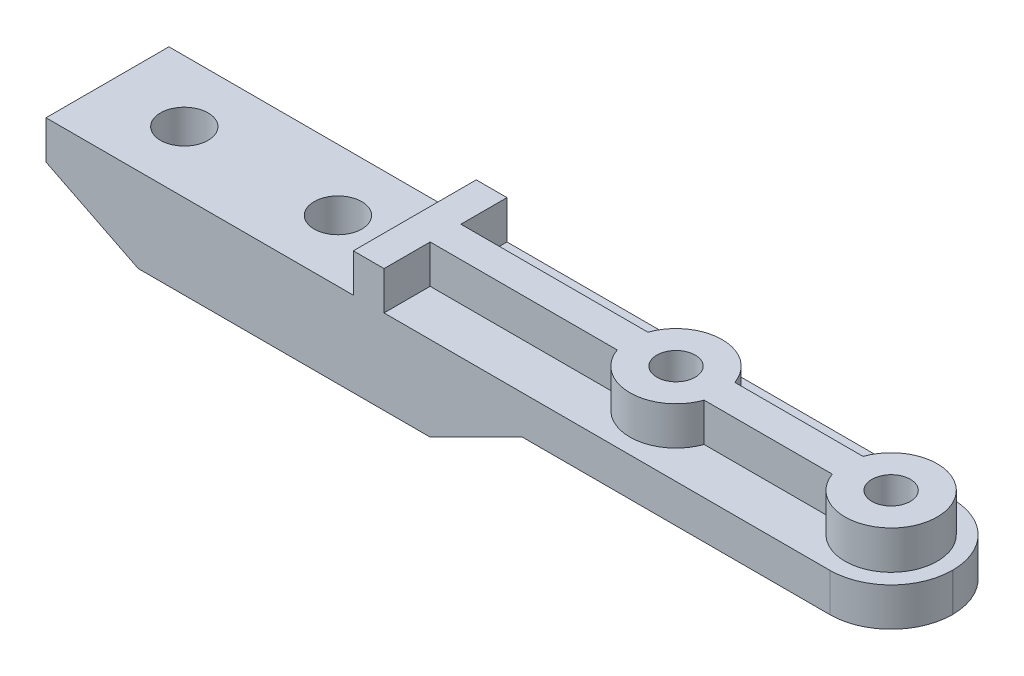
ISO-10303-21;
HEADER;
FILE_DESCRIPTION(('STEP AP214'),'2;1');
FILE_NAME('part.step','',(''),(''),'','','');
FILE_SCHEMA(('AUTOMOTIVE_DESIGN { 1 0 10303 214 1 1 1 1 }'));
ENDSEC;
DATA;
#1=APPLICATION_CONTEXT('core data for automotive mechanical design processes');
#2=APPLICATION_PROTOCOL_DEFINITION('international standard','automotive_design',2000,#1);
#3=PRODUCT_CONTEXT('',#1,'mechanical');
#4=PRODUCT('Part','Part','',(#3));
#5=PRODUCT_RELATED_PRODUCT_CATEGORY('part','',(#4));
#6=PRODUCT_DEFINITION_FORMATION('','',#4);
#7=PRODUCT_DEFINITION_CONTEXT('part definition',#1,'design');
#8=PRODUCT_DEFINITION('design','',#6,#7);
#9=PRODUCT_DEFINITION_SHAPE('','',#8);
#10=(LENGTH_UNIT() NAMED_UNIT(*) SI_UNIT(.MILLI.,.METRE.));
#11=(NAMED_UNIT(*) PLANE_ANGLE_UNIT() SI_UNIT($,.RADIAN.));
#12=(NAMED_UNIT(*) SI_UNIT($,.STERADIAN.) SOLID_ANGLE_UNIT());
#13=UNCERTAINTY_MEASURE_WITH_UNIT(LENGTH_MEASURE(1.E-05),#10,'distance_accuracy_value','');
#14=(GEOMETRIC_REPRESENTATION_CONTEXT(3) GLOBAL_UNCERTAINTY_ASSIGNED_CONTEXT((#13)) GLOBAL_UNIT_ASSIGNED_CONTEXT((#10,
#11,#12)) REPRESENTATION_CONTEXT('',''));
#15=CARTESIAN_POINT('',(0.,0.,0.));
#16=DIRECTION('',(0.,0.,1.));
#17=DIRECTION('',(1.,0.,0.));
#18=AXIS2_PLACEMENT_3D('',#15,#16,#17);
#19=CARTESIAN_POINT('',(-44.,0.,4.));
#20=DIRECTION('',(0.,1.,0.));
#21=DIRECTION('',(-1.,0.,0.));
#22=AXIS2_PLACEMENT_3D('',#19,#20,#21);
#23=PLANE('',#22);
#24=CARTESIAN_POINT('',(-29.,0.,0.));
#25=DIRECTION('',(0.,-1.,0.));
#26=DIRECTION('',(0.,0.,-1.));
#27=AXIS2_PLACEMENT_3D('',#24,#25,#26);
#28=CIRCLE('',#27,1.55);
#29=CARTESIAN_POINT('',(-29.,0.,-1.55));
#30=VERTEX_POINT('',#29);
#31=EDGE_CURVE('E269',#30,#30,#28,.T.);
#32=ORIENTED_EDGE('',*,*,#31,.F.);
#33=EDGE_LOOP('',(#32));
#34=FACE_BOUND('',#33,.T.);
#35=CARTESIAN_POINT('',(-39.,0.,0.));
#36=DIRECTION('',(0.,-1.,0.));
#37=DIRECTION('',(0.,0.,-1.));
#38=AXIS2_PLACEMENT_3D('',#35,#36,#37);
#39=CIRCLE('',#38,1.55);
#40=CARTESIAN_POINT('',(-39.,0.,-1.55));
#41=VERTEX_POINT('',#40);
#42=EDGE_CURVE('E278',#41,#41,#39,.T.);
#43=ORIENTED_EDGE('',*,*,#42,.F.);
#44=EDGE_LOOP('',(#43));
#45=FACE_BOUND('',#44,.T.);
#46=CARTESIAN_POINT('',(-7.,0.,0.));
#47=DIRECTION('',(0.,-1.,0.));
#48=DIRECTION('',(0.,0.,-1.));
#49=AXIS2_PLACEMENT_3D('',#46,#47,#48);
#50=CIRCLE('',#49,1.25);
#51=CARTESIAN_POINT('',(-7.,0.,-1.25));
#52=VERTEX_POINT('',#51);
#53=EDGE_CURVE('E284',#52,#52,#50,.T.);
#54=ORIENTED_EDGE('',*,*,#53,.F.);
#55=EDGE_LOOP('',(#54));
#56=FACE_BOUND('',#55,.T.);
#57=CARTESIAN_POINT('',(7.,0.,0.));
#58=DIRECTION('',(0.,-1.,0.));
#59=DIRECTION('',(0.,0.,-1.));
#60=AXIS2_PLACEMENT_3D('',#57,#58,#59);
#61=CIRCLE('',#60,1.25);
#62=CARTESIAN_POINT('',(7.,0.,-1.25));
#63=VERTEX_POINT('',#62);
#64=EDGE_CURVE('E290',#63,#63,#61,.T.);
#65=ORIENTED_EDGE('',*,*,#64,.F.);
#66=EDGE_LOOP('',(#65));
#67=FACE_BOUND('',#66,.T.);
#68=DIRECTION('',(-1.,0.,0.));
#69=VECTOR('',#68,1.);
#70=CARTESIAN_POINT('',(-13.,0.,-3.));
#71=LINE('',#70,#69);
#72=CARTESIAN_POINT('',(-13.,0.,-3.));
#73=VERTEX_POINT('',#72);
#74=CARTESIAN_POINT('',(-44.,0.,-3.));
#75=VERTEX_POINT('',#74);
#76=EDGE_CURVE('E215',#73,#75,#71,.T.);
#77=ORIENTED_EDGE('',*,*,#76,.F.);
#78=DIRECTION('',(0.,0.,1.));
#79=VECTOR('',#78,1.);
#80=CARTESIAN_POINT('',(-13.,0.,-3.));
#81=LINE('',#80,#79);
#82=CARTESIAN_POINT('',(-13.,0.,-4.));
#83=VERTEX_POINT('',#82);
#84=EDGE_CURVE('E212',#83,#73,#81,.T.);
#85=ORIENTED_EDGE('',*,*,#84,.F.);
#86=DIRECTION('',(1.,0.,0.));
#87=VECTOR('',#86,1.);
#88=CARTESIAN_POINT('',(-44.,0.,-4.));
#89=LINE('',#88,#87);
#90=CARTESIAN_POINT('',(7.01,0.,-4.));
#91=VERTEX_POINT('',#90);
#92=EDGE_CURVE('E195',#83,#91,#89,.T.);
#93=ORIENTED_EDGE('',*,*,#92,.T.);
#94=CARTESIAN_POINT('',(7.00999999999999,0.,-0.00999999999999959));
#95=DIRECTION('',(0.,1.,0.));
#96=DIRECTION('',(-1.,0.,0.));
#97=AXIS2_PLACEMENT_3D('',#94,#95,#96);
#98=CIRCLE('',#97,3.99);
#99=CARTESIAN_POINT('',(11.,0.,-0.00999999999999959));
#100=VERTEX_POINT('',#99);
#101=EDGE_CURVE('E396',#91,#100,#98,.F.);
#102=ORIENTED_EDGE('',*,*,#101,.T.);
#103=DIRECTION('',(0.,0.,-1.));
#104=VECTOR('',#103,1.);
#105=CARTESIAN_POINT('',(11.,0.,4.));
#106=LINE('',#105,#104);
#107=CARTESIAN_POINT('',(11.,0.,0.00999999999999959));
#108=VERTEX_POINT('',#107);
#109=EDGE_CURVE('E260',#108,#100,#106,.T.);
#110=ORIENTED_EDGE('',*,*,#109,.F.);
#111=CARTESIAN_POINT('',(7.01,0.,0.00999999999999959));
#112=DIRECTION('',(0.,1.,0.));
#113=DIRECTION('',(-1.,0.,0.));
#114=AXIS2_PLACEMENT_3D('',#111,#112,#113);
#115=CIRCLE('',#114,3.99);
#116=CARTESIAN_POINT('',(7.01,0.,4.));
#117=VERTEX_POINT('',#116);
#118=EDGE_CURVE('E398',#108,#117,#115,.F.);
#119=ORIENTED_EDGE('',*,*,#118,.T.);
#120=DIRECTION('',(1.,0.,0.));
#121=VECTOR('',#120,1.);
#122=CARTESIAN_POINT('',(-44.,0.,4.));
#123=LINE('',#122,#121);
#124=CARTESIAN_POINT('',(-13.,0.,4.));
#125=VERTEX_POINT('',#124);
#126=EDGE_CURVE('E371',#125,#117,#123,.T.);
#127=ORIENTED_EDGE('',*,*,#126,.F.);
#128=DIRECTION('',(0.,0.,1.));
#129=VECTOR('',#128,1.);
#130=CARTESIAN_POINT('',(-13.,0.,3.));
#131=LINE('',#130,#129);
#132=CARTESIAN_POINT('',(-13.,0.,3.));
#133=VERTEX_POINT('',#132);
#134=EDGE_CURVE('E251',#133,#125,#131,.T.);
#135=ORIENTED_EDGE('',*,*,#134,.F.);
#136=DIRECTION('',(1.,0.,0.));
#137=VECTOR('',#136,1.);
#138=CARTESIAN_POINT('',(-13.,0.,3.));
#139=LINE('',#138,#137);
#140=CARTESIAN_POINT('',(-44.,0.,3.));
#141=VERTEX_POINT('',#140);
#142=EDGE_CURVE('E244',#141,#133,#139,.T.);
#143=ORIENTED_EDGE('',*,*,#142,.F.);
#144=DIRECTION('',(0.,0.,-1.));
#145=VECTOR('',#144,1.);
#146=CARTESIAN_POINT('',(-44.,0.,4.));
#147=LINE('',#146,#145);
#148=EDGE_CURVE('E248',#141,#75,#147,.T.);
#149=ORIENTED_EDGE('',*,*,#148,.T.);
#150=EDGE_LOOP('',(#77,#85,#93,#102,#110,#119,#127,#135,#143,#149));
#151=FACE_BOUND('',#150,.T.);
#152=ADVANCED_FACE('F28',(#34,#45,#56,#67,#151),#23,.F.);
#153=CARTESIAN_POINT('',(-44.,2.5,4.));
#154=DIRECTION('',(0.,-1.,0.));
#155=DIRECTION('',(0.,0.,-1.));
#156=AXIS2_PLACEMENT_3D('',#153,#154,#155);
#157=PLANE('',#156);
#158=CARTESIAN_POINT('',(-29.,2.5,0.));
#159=DIRECTION('',(0.,-1.,0.));
#160=DIRECTION('',(0.,0.,-1.));
#161=AXIS2_PLACEMENT_3D('',#158,#159,#160);
#162=CIRCLE('',#161,1.55);
#163=CARTESIAN_POINT('',(-29.,2.5,-1.55));
#164=VERTEX_POINT('',#163);
#165=EDGE_CURVE('E275',#164,#164,#162,.T.);
#166=ORIENTED_EDGE('',*,*,#165,.T.);
#167=EDGE_LOOP('',(#166));
#168=FACE_BOUND('',#167,.T.);
#169=CARTESIAN_POINT('',(-39.,2.5,0.));
#170=DIRECTION('',(0.,-1.,0.));
#171=DIRECTION('',(0.,0.,-1.));
#172=AXIS2_PLACEMENT_3D('',#169,#170,#171);
#173=CIRCLE('',#172,1.55);
#174=CARTESIAN_POINT('',(-39.,2.5,-1.55));
#175=VERTEX_POINT('',#174);
#176=EDGE_CURVE('E281',#175,#175,#173,.T.);
#177=ORIENTED_EDGE('',*,*,#176,.T.);
#178=EDGE_LOOP('',(#177));
#179=FACE_BOUND('',#178,.T.);
#180=DIRECTION('',(0.,0.,1.));
#181=VECTOR('',#180,1.);
#182=CARTESIAN_POINT('',(-24.,2.5,4.));
#183=LINE('',#182,#181);
#184=CARTESIAN_POINT('',(-24.,2.5,-4.));
#185=VERTEX_POINT('',#184);
#186=CARTESIAN_POINT('',(-24.,2.5,4.));
#187=VERTEX_POINT('',#186);
#188=EDGE_CURVE('E357',#185,#187,#183,.T.);
#189=ORIENTED_EDGE('',*,*,#188,.F.);
#190=DIRECTION('',(-1.,0.,0.));
#191=VECTOR('',#190,1.);
#192=CARTESIAN_POINT('',(-44.,2.5,-4.));
#193=LINE('',#192,#191);
#194=CARTESIAN_POINT('',(-44.,2.5,-4.));
#195=VERTEX_POINT('',#194);
#196=EDGE_CURVE('E207',#185,#195,#193,.T.);
#197=ORIENTED_EDGE('',*,*,#196,.T.);
#198=DIRECTION('',(0.,0.,-1.));
#199=VECTOR('',#198,1.);
#200=CARTESIAN_POINT('',(-44.,2.5,4.));
#201=LINE('',#200,#199);
#202=CARTESIAN_POINT('',(-44.,2.5,4.));
#203=VERTEX_POINT('',#202);
#204=EDGE_CURVE('E377',#203,#195,#201,.T.);
#205=ORIENTED_EDGE('',*,*,#204,.F.);
#206=DIRECTION('',(-1.,0.,0.));
#207=VECTOR('',#206,1.);
#208=CARTESIAN_POINT('',(-44.,2.5,4.));
#209=LINE('',#208,#207);
#210=EDGE_CURVE('E373',#187,#203,#209,.T.);
#211=ORIENTED_EDGE('',*,*,#210,.F.);
#212=EDGE_LOOP('',(#189,#197,#205,#211));
#213=FACE_BOUND('',#212,.T.);
#214=ADVANCED_FACE('F474',(#168,#179,#213),#157,.F.);
#215=DIRECTION('',(0.,0.,-1.));
#216=VECTOR('',#215,1.);
#217=CARTESIAN_POINT('',(-22.,2.5,4.));
#218=LINE('',#217,#216);
#219=CARTESIAN_POINT('',(-22.,2.5,-1.));
#220=VERTEX_POINT('',#219);
#221=CARTESIAN_POINT('',(-22.,2.5,-4.));
#222=VERTEX_POINT('',#221);
#223=EDGE_CURVE('E360',#220,#222,#218,.T.);
#224=ORIENTED_EDGE('',*,*,#223,.F.);
#225=DIRECTION('',(-1.,0.,0.));
#226=VECTOR('',#225,1.);
#227=CARTESIAN_POINT('',(-44.,2.5,-1.));
#228=LINE('',#227,#226);
#229=CARTESIAN_POINT('',(-9.82842712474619,2.5,-1.));
#230=VERTEX_POINT('',#229);
#231=EDGE_CURVE('E420',#230,#220,#228,.T.);
#232=ORIENTED_EDGE('',*,*,#231,.F.);
#233=CARTESIAN_POINT('',(-7.,2.5,0.));
#234=DIRECTION('',(0.,-1.,0.));
#235=DIRECTION('',(0.,0.,-1.));
#236=AXIS2_PLACEMENT_3D('',#233,#234,#235);
#237=CIRCLE('',#236,3.);
#238=CARTESIAN_POINT('',(-4.17157287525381,2.5,-1.));
#239=VERTEX_POINT('',#238);
#240=EDGE_CURVE('E417',#239,#230,#237,.F.);
#241=ORIENTED_EDGE('',*,*,#240,.F.);
#242=DIRECTION('',(-1.,0.,0.));
#243=VECTOR('',#242,1.);
#244=CARTESIAN_POINT('',(-44.,2.5,-1.));
#245=LINE('',#244,#243);
#246=CARTESIAN_POINT('',(4.17157287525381,2.5,-1.));
#247=VERTEX_POINT('',#246);
#248=EDGE_CURVE('E414',#247,#239,#245,.T.);
#249=ORIENTED_EDGE('',*,*,#248,.F.);
#250=CARTESIAN_POINT('',(7.,2.5,0.));
#251=DIRECTION('',(0.,-1.,0.));
#252=DIRECTION('',(0.,0.,-1.));
#253=AXIS2_PLACEMENT_3D('',#250,#251,#252);
#254=CIRCLE('',#253,3.);
#255=CARTESIAN_POINT('',(4.17157287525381,2.5,1.));
#256=VERTEX_POINT('',#255);
#257=EDGE_CURVE('E411',#256,#247,#254,.F.);
#258=ORIENTED_EDGE('',*,*,#257,.F.);
#259=DIRECTION('',(1.,0.,0.));
#260=VECTOR('',#259,1.);
#261=CARTESIAN_POINT('',(-44.,2.5,1.));
#262=LINE('',#261,#260);
#263=CARTESIAN_POINT('',(-4.17157287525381,2.5,1.));
#264=VERTEX_POINT('',#263);
#265=EDGE_CURVE('E408',#264,#256,#262,.T.);
#266=ORIENTED_EDGE('',*,*,#265,.F.);
#267=CARTESIAN_POINT('',(-7.,2.5,0.));
#268=DIRECTION('',(0.,-1.,0.));
#269=DIRECTION('',(0.,0.,-1.));
#270=AXIS2_PLACEMENT_3D('',#267,#268,#269);
#271=CIRCLE('',#270,3.);
#272=CARTESIAN_POINT('',(-9.82842712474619,2.5,1.));
#273=VERTEX_POINT('',#272);
#274=EDGE_CURVE('E405',#273,#264,#271,.F.);
#275=ORIENTED_EDGE('',*,*,#274,.F.);
#276=DIRECTION('',(1.,0.,0.));
#277=VECTOR('',#276,1.);
#278=CARTESIAN_POINT('',(-44.,2.5,1.));
#279=LINE('',#278,#277);
#280=CARTESIAN_POINT('',(-22.,2.5,1.));
#281=VERTEX_POINT('',#280);
#282=EDGE_CURVE('E402',#281,#273,#279,.T.);
#283=ORIENTED_EDGE('',*,*,#282,.F.);
#284=DIRECTION('',(0.,0.,-1.));
#285=VECTOR('',#284,1.);
#286=CARTESIAN_POINT('',(-22.,2.5,4.));
#287=LINE('',#286,#285);
#288=CARTESIAN_POINT('',(-22.,2.5,4.));
#289=VERTEX_POINT('',#288);
#290=EDGE_CURVE('E363',#289,#281,#287,.T.);
#291=ORIENTED_EDGE('',*,*,#290,.F.);
#292=CARTESIAN_POINT('',(7.01,2.5,4.));
#293=VERTEX_POINT('',#292);
#294=EDGE_CURVE('E374',#293,#289,#209,.T.);
#295=ORIENTED_EDGE('',*,*,#294,.F.);
#296=CARTESIAN_POINT('',(7.01,2.5,0.00999999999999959));
#297=DIRECTION('',(0.,-1.,0.));
#298=DIRECTION('',(0.,0.,-1.));
#299=AXIS2_PLACEMENT_3D('',#296,#297,#298);
#300=CIRCLE('',#299,3.99);
#301=CARTESIAN_POINT('',(11.,2.5,0.00999999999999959));
#302=VERTEX_POINT('',#301);
#303=EDGE_CURVE('E389',#293,#302,#300,.F.);
#304=ORIENTED_EDGE('',*,*,#303,.T.);
#305=DIRECTION('',(0.,0.,-1.));
#306=VECTOR('',#305,1.);
#307=CARTESIAN_POINT('',(11.,2.5,4.));
#308=LINE('',#307,#306);
#309=CARTESIAN_POINT('',(11.,2.5,-0.00999999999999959));
#310=VERTEX_POINT('',#309);
#311=EDGE_CURVE('E380',#302,#310,#308,.T.);
#312=ORIENTED_EDGE('',*,*,#311,.T.);
#313=CARTESIAN_POINT('',(7.00999999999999,2.5,-0.00999999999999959));
#314=DIRECTION('',(0.,-1.,0.));
#315=DIRECTION('',(0.,0.,-1.));
#316=AXIS2_PLACEMENT_3D('',#313,#314,#315);
#317=CIRCLE('',#316,3.99);
#318=CARTESIAN_POINT('',(7.01,2.5,-4.));
#319=VERTEX_POINT('',#318);
#320=EDGE_CURVE('E387',#310,#319,#317,.F.);
#321=ORIENTED_EDGE('',*,*,#320,.T.);
#322=EDGE_CURVE('E367',#319,#222,#193,.T.);
#323=ORIENTED_EDGE('',*,*,#322,.T.);
#324=EDGE_LOOP('',(#224,#232,#241,#249,#258,#266,#275,#283,#291,#295,#304,#312,#321,#323));
#325=FACE_BOUND('',#324,.T.);
#326=ADVANCED_FACE('F451',(#325),#157,.F.);
#327=CARTESIAN_POINT('',(-44.,2.5,4.));
#328=DIRECTION('',(1.,0.,0.));
#329=DIRECTION('',(0.,0.,-1.));
#330=AXIS2_PLACEMENT_3D('',#327,#328,#329);
#331=PLANE('',#330);
#332=DIRECTION('',(0.,-1.,0.));
#333=VECTOR('',#332,1.);
#334=CARTESIAN_POINT('',(-44.,2.5,-4.));
#335=LINE('',#334,#333);
#336=CARTESIAN_POINT('',(-44.,0.,-4.));
#337=VERTEX_POINT('',#336);
#338=EDGE_CURVE('E208',#195,#337,#335,.T.);
#339=ORIENTED_EDGE('',*,*,#338,.T.);
#340=DIRECTION('',(0.,0.,1.));
#341=VECTOR('',#340,1.);
#342=CARTESIAN_POINT('',(-44.,0.,-3.));
#343=LINE('',#342,#341);
#344=EDGE_CURVE('E234',#337,#75,#343,.T.);
#345=ORIENTED_EDGE('',*,*,#344,.T.);
#346=ORIENTED_EDGE('',*,*,#148,.F.);
#347=DIRECTION('',(0.,0.,1.));
#348=VECTOR('',#347,1.);
#349=CARTESIAN_POINT('',(-44.,0.,4.));
#350=LINE('',#349,#348);
#351=CARTESIAN_POINT('',(-44.,0.,4.));
#352=VERTEX_POINT('',#351);
#353=EDGE_CURVE('E232',#141,#352,#350,.T.);
#354=ORIENTED_EDGE('',*,*,#353,.T.);
#355=DIRECTION('',(0.,-1.,0.));
#356=VECTOR('',#355,1.);
#357=CARTESIAN_POINT('',(-44.,2.5,4.));
#358=LINE('',#357,#356);
#359=EDGE_CURVE('E369',#203,#352,#358,.T.);
#360=ORIENTED_EDGE('',*,*,#359,.F.);
#361=ORIENTED_EDGE('',*,*,#204,.T.);
#362=EDGE_LOOP('',(#339,#345,#346,#354,#360,#361));
#363=FACE_BOUND('',#362,.T.);
#364=ADVANCED_FACE('F30',(#363),#331,.F.);
#365=CARTESIAN_POINT('',(11.,2.5,4.));
#366=DIRECTION('',(-1.,0.,0.));
#367=DIRECTION('',(0.,0.,1.));
#368=AXIS2_PLACEMENT_3D('',#365,#366,#367);
#369=PLANE('',#368);
#370=ORIENTED_EDGE('',*,*,#311,.F.);
#371=DIRECTION('',(0.,1.,0.));
#372=VECTOR('',#371,1.);
#373=CARTESIAN_POINT('',(11.,0.,0.00999999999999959));
#374=LINE('',#373,#372);
#375=EDGE_CURVE('E394',#302,#108,#374,.F.);
#376=ORIENTED_EDGE('',*,*,#375,.T.);
#377=ORIENTED_EDGE('',*,*,#109,.T.);
#378=DIRECTION('',(0.,1.,0.));
#379=VECTOR('',#378,1.);
#380=CARTESIAN_POINT('',(11.,2.5,-0.00999999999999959));
#381=LINE('',#380,#379);
#382=EDGE_CURVE('E391',#100,#310,#381,.T.);
#383=ORIENTED_EDGE('',*,*,#382,.T.);
#384=EDGE_LOOP('',(#370,#376,#377,#383));
#385=FACE_BOUND('',#384,.T.);
#386=ADVANCED_FACE('F499',(#385),#369,.F.);
#387=CARTESIAN_POINT('',(-44.,2.5,4.));
#388=DIRECTION('',(0.,0.,1.));
#389=DIRECTION('',(1.,0.,0.));
#390=AXIS2_PLACEMENT_3D('',#387,#388,#389);
#391=PLANE('',#390);
#392=ORIENTED_EDGE('',*,*,#359,.T.);
#393=DIRECTION('',(0.894427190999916,-0.447213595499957,0.));
#394=VECTOR('',#393,1.);
#395=CARTESIAN_POINT('',(-45.,0.500000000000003,4.));
#396=LINE('',#395,#394);
#397=CARTESIAN_POINT('',(-38.,-2.99999999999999,4.));
#398=VERTEX_POINT('',#397);
#399=EDGE_CURVE('E11',#352,#398,#396,.T.);
#400=ORIENTED_EDGE('',*,*,#399,.T.);
#401=DIRECTION('',(-1.,0.,0.));
#402=VECTOR('',#401,1.);
#403=CARTESIAN_POINT('',(-13.,-3.,4.));
#404=LINE('',#403,#402);
#405=CARTESIAN_POINT('',(-19.,-2.99999999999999,4.));
#406=VERTEX_POINT('',#405);
#407=EDGE_CURVE('E253',#406,#398,#404,.T.);
#408=ORIENTED_EDGE('',*,*,#407,.F.);
#409=DIRECTION('',(0.894427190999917,0.447213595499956,0.));
#410=VECTOR('',#409,1.);
#411=CARTESIAN_POINT('',(-36.8000000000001,-11.9,4.));
#412=LINE('',#411,#410);
#413=EDGE_CURVE('E424',#406,#125,#412,.T.);
#414=ORIENTED_EDGE('',*,*,#413,.T.);
#415=ORIENTED_EDGE('',*,*,#126,.T.);
#416=DIRECTION('',(0.,1.,0.));
#417=VECTOR('',#416,1.);
#418=CARTESIAN_POINT('',(7.01,2.5,4.));
#419=LINE('',#418,#417);
#420=EDGE_CURVE('E259',#117,#293,#419,.T.);
#421=ORIENTED_EDGE('',*,*,#420,.T.);
#422=ORIENTED_EDGE('',*,*,#294,.T.);
#423=DIRECTION('',(0.,-1.,0.));
#424=VECTOR('',#423,1.);
#425=CARTESIAN_POINT('',(-22.,5.,4.));
#426=LINE('',#425,#424);
#427=CARTESIAN_POINT('',(-22.,5.,4.));
#428=VERTEX_POINT('',#427);
#429=EDGE_CURVE('E327',#428,#289,#426,.T.);
#430=ORIENTED_EDGE('',*,*,#429,.F.);
#431=DIRECTION('',(1.,0.,0.));
#432=VECTOR('',#431,1.);
#433=CARTESIAN_POINT('',(-24.,5.,4.));
#434=LINE('',#433,#432);
#435=CARTESIAN_POINT('',(-24.,5.,4.));
#436=VERTEX_POINT('',#435);
#437=EDGE_CURVE('E315',#436,#428,#434,.T.);
#438=ORIENTED_EDGE('',*,*,#437,.F.);
#439=DIRECTION('',(0.,-1.,0.));
#440=VECTOR('',#439,1.);
#441=CARTESIAN_POINT('',(-24.,5.,4.));
#442=LINE('',#441,#440);
#443=EDGE_CURVE('E330',#436,#187,#442,.T.);
#444=ORIENTED_EDGE('',*,*,#443,.T.);
#445=ORIENTED_EDGE('',*,*,#210,.T.);
#446=EDGE_LOOP('',(#392,#400,#408,#414,#415,#421,#422,#430,#438,#444,#445));
#447=FACE_BOUND('',#446,.T.);
#448=ADVANCED_FACE('F441',(#447),#391,.T.);
#449=CARTESIAN_POINT('',(-44.,2.5,-4.));
#450=DIRECTION('',(0.,0.,1.));
#451=DIRECTION('',(1.,0.,0.));
#452=AXIS2_PLACEMENT_3D('',#449,#450,#451);
#453=PLANE('',#452);
#454=DIRECTION('',(1.,0.,0.));
#455=VECTOR('',#454,1.);
#456=CARTESIAN_POINT('',(-13.,-3.,-4.));
#457=LINE('',#456,#455);
#458=CARTESIAN_POINT('',(-38.,-2.99999999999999,-4.));
#459=VERTEX_POINT('',#458);
#460=CARTESIAN_POINT('',(-19.,-3.,-4.));
#461=VERTEX_POINT('',#460);
#462=EDGE_CURVE('E432',#459,#461,#457,.T.);
#463=ORIENTED_EDGE('',*,*,#462,.F.);
#464=DIRECTION('',(-0.894427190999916,0.447213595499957,0.));
#465=VECTOR('',#464,1.);
#466=CARTESIAN_POINT('',(-38.,-3.,-4.));
#467=LINE('',#466,#465);
#468=EDGE_CURVE('E226',#459,#337,#467,.T.);
#469=ORIENTED_EDGE('',*,*,#468,.T.);
#470=ORIENTED_EDGE('',*,*,#338,.F.);
#471=ORIENTED_EDGE('',*,*,#196,.F.);
#472=DIRECTION('',(0.,-1.,0.));
#473=VECTOR('',#472,1.);
#474=CARTESIAN_POINT('',(-24.,5.,-4.));
#475=LINE('',#474,#473);
#476=CARTESIAN_POINT('',(-24.,5.,-4.));
#477=VERTEX_POINT('',#476);
#478=EDGE_CURVE('E333',#477,#185,#475,.T.);
#479=ORIENTED_EDGE('',*,*,#478,.F.);
#480=DIRECTION('',(-1.,0.,0.));
#481=VECTOR('',#480,1.);
#482=CARTESIAN_POINT('',(-22.,5.,-4.));
#483=LINE('',#482,#481);
#484=CARTESIAN_POINT('',(-22.,5.,-4.));
#485=VERTEX_POINT('',#484);
#486=EDGE_CURVE('E311',#485,#477,#483,.T.);
#487=ORIENTED_EDGE('',*,*,#486,.F.);
#488=DIRECTION('',(0.,-1.,0.));
#489=VECTOR('',#488,1.);
#490=CARTESIAN_POINT('',(-22.,5.,-4.));
#491=LINE('',#490,#489);
#492=EDGE_CURVE('E336',#485,#222,#491,.T.);
#493=ORIENTED_EDGE('',*,*,#492,.T.);
#494=ORIENTED_EDGE('',*,*,#322,.F.);
#495=DIRECTION('',(0.,1.,0.));
#496=VECTOR('',#495,1.);
#497=CARTESIAN_POINT('',(7.01,2.5,-4.));
#498=LINE('',#497,#496);
#499=EDGE_CURVE('E204',#319,#91,#498,.F.);
#500=ORIENTED_EDGE('',*,*,#499,.T.);
#501=ORIENTED_EDGE('',*,*,#92,.F.);
#502=DIRECTION('',(-0.894427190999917,-0.447213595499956,0.));
#503=VECTOR('',#502,1.);
#504=CARTESIAN_POINT('',(-19.,-3.,-4.));
#505=LINE('',#504,#503);
#506=EDGE_CURVE('E200',#83,#461,#505,.T.);
#507=ORIENTED_EDGE('',*,*,#506,.T.);
#508=EDGE_LOOP('',(#463,#469,#470,#471,#479,#487,#493,#494,#500,#501,#507));
#509=FACE_BOUND('',#508,.T.);
#510=ADVANCED_FACE('F198',(#509),#453,.F.);
#511=CARTESIAN_POINT('',(7.01,2.5,0.00999999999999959));
#512=DIRECTION('',(0.,-1.,0.));
#513=DIRECTION('',(0.,0.,-1.));
#514=AXIS2_PLACEMENT_3D('',#511,#512,#513);
#515=CYLINDRICAL_SURFACE('',#514,3.99);
#516=ORIENTED_EDGE('',*,*,#118,.F.);
#517=ORIENTED_EDGE('',*,*,#375,.F.);
#518=ORIENTED_EDGE('',*,*,#303,.F.);
#519=ORIENTED_EDGE('',*,*,#420,.F.);
#520=EDGE_LOOP('',(#516,#517,#518,#519));
#521=FACE_BOUND('',#520,.T.);
#522=ADVANCED_FACE('F447',(#521),#515,.T.);
#523=CARTESIAN_POINT('',(7.00999999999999,2.5,-0.00999999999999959));
#524=DIRECTION('',(0.,1.,0.));
#525=DIRECTION('',(0.,0.,1.));
#526=AXIS2_PLACEMENT_3D('',#523,#524,#525);
#527=CYLINDRICAL_SURFACE('',#526,3.99);
#528=ORIENTED_EDGE('',*,*,#101,.F.);
#529=ORIENTED_EDGE('',*,*,#499,.F.);
#530=ORIENTED_EDGE('',*,*,#320,.F.);
#531=ORIENTED_EDGE('',*,*,#382,.F.);
#532=EDGE_LOOP('',(#528,#529,#530,#531));
#533=FACE_BOUND('',#532,.T.);
#534=ADVANCED_FACE('F509',(#533),#527,.T.);
#535=CARTESIAN_POINT('',(-7.,5.,0.));
#536=DIRECTION('',(0.,-1.,0.));
#537=DIRECTION('',(0.,0.,-1.));
#538=AXIS2_PLACEMENT_3D('',#535,#536,#537);
#539=CYLINDRICAL_SURFACE('',#538,3.);
#540=DIRECTION('',(0.,-1.,0.));
#541=VECTOR('',#540,1.);
#542=CARTESIAN_POINT('',(-9.82842712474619,5.,1.));
#543=LINE('',#542,#541);
#544=CARTESIAN_POINT('',(-9.82842712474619,5.,1.));
#545=VERTEX_POINT('',#544);
#546=EDGE_CURVE('E321',#545,#273,#543,.T.);
#547=ORIENTED_EDGE('',*,*,#546,.T.);
#548=ORIENTED_EDGE('',*,*,#274,.T.);
#549=DIRECTION('',(0.,-1.,0.));
#550=VECTOR('',#549,1.);
#551=CARTESIAN_POINT('',(-4.17157287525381,5.,1.));
#552=LINE('',#551,#550);
#553=CARTESIAN_POINT('',(-4.17157287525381,5.,1.));
#554=VERTEX_POINT('',#553);
#555=EDGE_CURVE('E354',#554,#264,#552,.T.);
#556=ORIENTED_EDGE('',*,*,#555,.F.);
#557=CARTESIAN_POINT('',(-7.,5.,0.));
#558=DIRECTION('',(0.,1.,0.));
#559=DIRECTION('',(0.,0.,1.));
#560=AXIS2_PLACEMENT_3D('',#557,#558,#559);
#561=CIRCLE('',#560,3.);
#562=EDGE_CURVE('E296',#545,#554,#561,.T.);
#563=ORIENTED_EDGE('',*,*,#562,.F.);
#564=EDGE_LOOP('',(#547,#548,#556,#563));
#565=FACE_BOUND('',#564,.T.);
#566=ADVANCED_FACE('F512',(#565),#539,.T.);
#567=CARTESIAN_POINT('',(-4.17157287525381,5.,1.));
#568=DIRECTION('',(0.,0.,-1.));
#569=DIRECTION('',(-1.,0.,0.));
#570=AXIS2_PLACEMENT_3D('',#567,#568,#569);
#571=PLANE('',#570);
#572=ORIENTED_EDGE('',*,*,#555,.T.);
#573=ORIENTED_EDGE('',*,*,#265,.T.);
#574=DIRECTION('',(0.,-1.,0.));
#575=VECTOR('',#574,1.);
#576=CARTESIAN_POINT('',(4.17157287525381,5.,0.999999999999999));
#577=LINE('',#576,#575);
#578=CARTESIAN_POINT('',(4.17157287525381,5.,0.999999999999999));
#579=VERTEX_POINT('',#578);
#580=EDGE_CURVE('E351',#579,#256,#577,.T.);
#581=ORIENTED_EDGE('',*,*,#580,.F.);
#582=DIRECTION('',(1.,0.,0.));
#583=VECTOR('',#582,1.);
#584=CARTESIAN_POINT('',(-4.17157287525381,5.,1.));
#585=LINE('',#584,#583);
#586=EDGE_CURVE('E299',#554,#579,#585,.T.);
#587=ORIENTED_EDGE('',*,*,#586,.F.);
#588=EDGE_LOOP('',(#572,#573,#581,#587));
#589=FACE_BOUND('',#588,.T.);
#590=ADVANCED_FACE('F516',(#589),#571,.F.);
#591=CARTESIAN_POINT('',(7.,5.,0.));
#592=DIRECTION('',(0.,-1.,0.));
#593=DIRECTION('',(0.,0.,-1.));
#594=AXIS2_PLACEMENT_3D('',#591,#592,#593);
#595=CYLINDRICAL_SURFACE('',#594,3.);
#596=ORIENTED_EDGE('',*,*,#580,.T.);
#597=ORIENTED_EDGE('',*,*,#257,.T.);
#598=DIRECTION('',(0.,-1.,0.));
#599=VECTOR('',#598,1.);
#600=CARTESIAN_POINT('',(4.17157287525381,5.,-1.));
#601=LINE('',#600,#599);
#602=CARTESIAN_POINT('',(4.17157287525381,5.,-1.));
#603=VERTEX_POINT('',#602);
#604=EDGE_CURVE('E348',#603,#247,#601,.T.);
#605=ORIENTED_EDGE('',*,*,#604,.F.);
#606=CARTESIAN_POINT('',(7.,5.,0.));
#607=DIRECTION('',(0.,1.,0.));
#608=DIRECTION('',(0.,0.,1.));
#609=AXIS2_PLACEMENT_3D('',#606,#607,#608);
#610=CIRCLE('',#609,3.);
#611=EDGE_CURVE('E301',#579,#603,#610,.T.);
#612=ORIENTED_EDGE('',*,*,#611,.F.);
#613=EDGE_LOOP('',(#596,#597,#605,#612));
#614=FACE_BOUND('',#613,.T.);
#615=ADVANCED_FACE('F520',(#614),#595,.T.);
#616=CARTESIAN_POINT('',(-4.17157287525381,5.,-1.));
#617=DIRECTION('',(0.,0.,1.));
#618=DIRECTION('',(1.,0.,0.));
#619=AXIS2_PLACEMENT_3D('',#616,#617,#618);
#620=PLANE('',#619);
#621=ORIENTED_EDGE('',*,*,#604,.T.);
#622=ORIENTED_EDGE('',*,*,#248,.T.);
#623=DIRECTION('',(0.,-1.,0.));
#624=VECTOR('',#623,1.);
#625=CARTESIAN_POINT('',(-4.17157287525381,5.,-1.));
#626=LINE('',#625,#624);
#627=CARTESIAN_POINT('',(-4.17157287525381,5.,-1.));
#628=VERTEX_POINT('',#627);
#629=EDGE_CURVE('E345',#628,#239,#626,.T.);
#630=ORIENTED_EDGE('',*,*,#629,.F.);
#631=DIRECTION('',(-1.,0.,0.));
#632=VECTOR('',#631,1.);
#633=CARTESIAN_POINT('',(-4.17157287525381,5.,-1.));
#634=LINE('',#633,#632);
#635=EDGE_CURVE('E303',#603,#628,#634,.T.);
#636=ORIENTED_EDGE('',*,*,#635,.F.);
#637=EDGE_LOOP('',(#621,#622,#630,#636));
#638=FACE_BOUND('',#637,.T.);
#639=ADVANCED_FACE('F524',(#638),#620,.F.);
#640=CARTESIAN_POINT('',(-7.,5.,0.));
#641=DIRECTION('',(0.,-1.,0.));
#642=DIRECTION('',(0.,0.,-1.));
#643=AXIS2_PLACEMENT_3D('',#640,#641,#642);
#644=CYLINDRICAL_SURFACE('',#643,3.);
#645=ORIENTED_EDGE('',*,*,#629,.T.);
#646=ORIENTED_EDGE('',*,*,#240,.T.);
#647=DIRECTION('',(0.,-1.,0.));
#648=VECTOR('',#647,1.);
#649=CARTESIAN_POINT('',(-9.82842712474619,5.,-1.));
#650=LINE('',#649,#648);
#651=CARTESIAN_POINT('',(-9.82842712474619,5.,-1.));
#652=VERTEX_POINT('',#651);
#653=EDGE_CURVE('E342',#652,#230,#650,.T.);
#654=ORIENTED_EDGE('',*,*,#653,.F.);
#655=CARTESIAN_POINT('',(-7.,5.,0.));
#656=DIRECTION('',(0.,1.,0.));
#657=DIRECTION('',(0.,0.,1.));
#658=AXIS2_PLACEMENT_3D('',#655,#656,#657);
#659=CIRCLE('',#658,3.);
#660=EDGE_CURVE('E305',#628,#652,#659,.T.);
#661=ORIENTED_EDGE('',*,*,#660,.F.);
#662=EDGE_LOOP('',(#645,#646,#654,#661));
#663=FACE_BOUND('',#662,.T.);
#664=ADVANCED_FACE('F528',(#663),#644,.T.);
#665=CARTESIAN_POINT('',(-9.82842712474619,5.,-1.));
#666=DIRECTION('',(0.,0.,1.));
#667=DIRECTION('',(1.,0.,0.));
#668=AXIS2_PLACEMENT_3D('',#665,#666,#667);
#669=PLANE('',#668);
#670=ORIENTED_EDGE('',*,*,#653,.T.);
#671=ORIENTED_EDGE('',*,*,#231,.T.);
#672=DIRECTION('',(0.,-1.,0.));
#673=VECTOR('',#672,1.);
#674=CARTESIAN_POINT('',(-22.,5.,-1.));
#675=LINE('',#674,#673);
#676=CARTESIAN_POINT('',(-22.,5.,-1.));
#677=VERTEX_POINT('',#676);
#678=EDGE_CURVE('E339',#677,#220,#675,.T.);
#679=ORIENTED_EDGE('',*,*,#678,.F.);
#680=DIRECTION('',(-1.,0.,0.));
#681=VECTOR('',#680,1.);
#682=CARTESIAN_POINT('',(-9.82842712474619,5.,-1.));
#683=LINE('',#682,#681);
#684=EDGE_CURVE('E307',#652,#677,#683,.T.);
#685=ORIENTED_EDGE('',*,*,#684,.F.);
#686=EDGE_LOOP('',(#670,#671,#679,#685));
#687=FACE_BOUND('',#686,.T.);
#688=ADVANCED_FACE('F532',(#687),#669,.F.);
#689=CARTESIAN_POINT('',(-22.,5.,1.));
#690=DIRECTION('',(0.,0.,-1.));
#691=DIRECTION('',(-1.,0.,0.));
#692=AXIS2_PLACEMENT_3D('',#689,#690,#691);
#693=PLANE('',#692);
#694=DIRECTION('',(0.,-1.,0.));
#695=VECTOR('',#694,1.);
#696=CARTESIAN_POINT('',(-22.,5.,1.));
#697=LINE('',#696,#695);
#698=CARTESIAN_POINT('',(-22.,5.,1.));
#699=VERTEX_POINT('',#698);
#700=EDGE_CURVE('E324',#699,#281,#697,.T.);
#701=ORIENTED_EDGE('',*,*,#700,.T.);
#702=ORIENTED_EDGE('',*,*,#282,.T.);
#703=ORIENTED_EDGE('',*,*,#546,.F.);
#704=DIRECTION('',(1.,0.,0.));
#705=VECTOR('',#704,1.);
#706=CARTESIAN_POINT('',(-22.,5.,1.));
#707=LINE('',#706,#705);
#708=EDGE_CURVE('E319',#699,#545,#707,.T.);
#709=ORIENTED_EDGE('',*,*,#708,.F.);
#710=EDGE_LOOP('',(#701,#702,#703,#709));
#711=FACE_BOUND('',#710,.T.);
#712=ADVANCED_FACE('F459',(#711),#693,.F.);
#713=CARTESIAN_POINT('',(-22.,5.,4.));
#714=DIRECTION('',(-1.,0.,0.));
#715=DIRECTION('',(0.,0.,1.));
#716=AXIS2_PLACEMENT_3D('',#713,#714,#715);
#717=PLANE('',#716);
#718=ORIENTED_EDGE('',*,*,#429,.T.);
#719=ORIENTED_EDGE('',*,*,#290,.T.);
#720=ORIENTED_EDGE('',*,*,#700,.F.);
#721=DIRECTION('',(0.,0.,-1.));
#722=VECTOR('',#721,1.);
#723=CARTESIAN_POINT('',(-22.,5.,4.));
#724=LINE('',#723,#722);
#725=EDGE_CURVE('E317',#428,#699,#724,.T.);
#726=ORIENTED_EDGE('',*,*,#725,.F.);
#727=EDGE_LOOP('',(#718,#719,#720,#726));
#728=FACE_BOUND('',#727,.T.);
#729=ADVANCED_FACE('F455',(#728),#717,.F.);
#730=CARTESIAN_POINT('',(-22.,5.,-1.));
#731=DIRECTION('',(-1.,0.,0.));
#732=DIRECTION('',(0.,0.,1.));
#733=AXIS2_PLACEMENT_3D('',#730,#731,#732);
#734=PLANE('',#733);
#735=ORIENTED_EDGE('',*,*,#678,.T.);
#736=ORIENTED_EDGE('',*,*,#223,.T.);
#737=ORIENTED_EDGE('',*,*,#492,.F.);
#738=DIRECTION('',(0.,0.,-1.));
#739=VECTOR('',#738,1.);
#740=CARTESIAN_POINT('',(-22.,5.,-1.));
#741=LINE('',#740,#739);
#742=EDGE_CURVE('E309',#677,#485,#741,.T.);
#743=ORIENTED_EDGE('',*,*,#742,.F.);
#744=EDGE_LOOP('',(#735,#736,#737,#743));
#745=FACE_BOUND('',#744,.T.);
#746=ADVANCED_FACE('F537',(#745),#734,.F.);
#747=CARTESIAN_POINT('',(-24.,5.,-4.));
#748=DIRECTION('',(1.,0.,0.));
#749=DIRECTION('',(0.,0.,-1.));
#750=AXIS2_PLACEMENT_3D('',#747,#748,#749);
#751=PLANE('',#750);
#752=ORIENTED_EDGE('',*,*,#478,.T.);
#753=ORIENTED_EDGE('',*,*,#188,.T.);
#754=ORIENTED_EDGE('',*,*,#443,.F.);
#755=DIRECTION('',(0.,0.,1.));
#756=VECTOR('',#755,1.);
#757=CARTESIAN_POINT('',(-24.,5.,-4.));
#758=LINE('',#757,#756);
#759=EDGE_CURVE('E313',#477,#436,#758,.T.);
#760=ORIENTED_EDGE('',*,*,#759,.F.);
#761=EDGE_LOOP('',(#752,#753,#754,#760));
#762=FACE_BOUND('',#761,.T.);
#763=ADVANCED_FACE('F470',(#762),#751,.F.);
#764=CARTESIAN_POINT('',(-7.,5.,0.));
#765=DIRECTION('',(0.,1.,0.));
#766=DIRECTION('',(0.,0.,1.));
#767=AXIS2_PLACEMENT_3D('',#764,#765,#766);
#768=PLANE('',#767);
#769=CARTESIAN_POINT('',(-7.,5.,0.));
#770=DIRECTION('',(0.,-1.,0.));
#771=DIRECTION('',(0.,0.,-1.));
#772=AXIS2_PLACEMENT_3D('',#769,#770,#771);
#773=CIRCLE('',#772,1.25);
#774=CARTESIAN_POINT('',(-7.,5.,-1.25));
#775=VERTEX_POINT('',#774);
#776=EDGE_CURVE('E287',#775,#775,#773,.T.);
#777=ORIENTED_EDGE('',*,*,#776,.T.);
#778=EDGE_LOOP('',(#777));
#779=FACE_BOUND('',#778,.T.);
#780=CARTESIAN_POINT('',(7.,5.,0.));
#781=DIRECTION('',(0.,-1.,0.));
#782=DIRECTION('',(0.,0.,-1.));
#783=AXIS2_PLACEMENT_3D('',#780,#781,#782);
#784=CIRCLE('',#783,1.25);
#785=CARTESIAN_POINT('',(7.,5.,-1.25));
#786=VERTEX_POINT('',#785);
#787=EDGE_CURVE('E293',#786,#786,#784,.T.);
#788=ORIENTED_EDGE('',*,*,#787,.T.);
#789=EDGE_LOOP('',(#788));
#790=FACE_BOUND('',#789,.T.);
#791=ORIENTED_EDGE('',*,*,#562,.T.);
#792=ORIENTED_EDGE('',*,*,#586,.T.);
#793=ORIENTED_EDGE('',*,*,#611,.T.);
#794=ORIENTED_EDGE('',*,*,#635,.T.);
#795=ORIENTED_EDGE('',*,*,#660,.T.);
#796=ORIENTED_EDGE('',*,*,#684,.T.);
#797=ORIENTED_EDGE('',*,*,#742,.T.);
#798=ORIENTED_EDGE('',*,*,#486,.T.);
#799=ORIENTED_EDGE('',*,*,#759,.T.);
#800=ORIENTED_EDGE('',*,*,#437,.T.);
#801=ORIENTED_EDGE('',*,*,#725,.T.);
#802=ORIENTED_EDGE('',*,*,#708,.T.);
#803=EDGE_LOOP('',(#791,#792,#793,#794,#795,#796,#797,#798,#799,#800,#801,#802));
#804=FACE_BOUND('',#803,.T.);
#805=ADVANCED_FACE('F463',(#779,#790,#804),#768,.T.);
#806=CARTESIAN_POINT('',(7.,5.,0.));
#807=DIRECTION('',(0.,-1.,0.));
#808=DIRECTION('',(0.,0.,-1.));
#809=AXIS2_PLACEMENT_3D('',#806,#807,#808);
#810=CYLINDRICAL_SURFACE('',#809,1.25);
#811=ORIENTED_EDGE('',*,*,#787,.F.);
#812=EDGE_LOOP('',(#811));
#813=FACE_BOUND('',#812,.T.);
#814=ORIENTED_EDGE('',*,*,#64,.T.);
#815=EDGE_LOOP('',(#814));
#816=FACE_BOUND('',#815,.T.);
#817=ADVANCED_FACE('F549',(#813,#816),#810,.F.);
#818=CARTESIAN_POINT('',(-7.,5.,0.));
#819=DIRECTION('',(0.,-1.,0.));
#820=DIRECTION('',(0.,0.,-1.));
#821=AXIS2_PLACEMENT_3D('',#818,#819,#820);
#822=CYLINDRICAL_SURFACE('',#821,1.25);
#823=ORIENTED_EDGE('',*,*,#776,.F.);
#824=EDGE_LOOP('',(#823));
#825=FACE_BOUND('',#824,.T.);
#826=ORIENTED_EDGE('',*,*,#53,.T.);
#827=EDGE_LOOP('',(#826));
#828=FACE_BOUND('',#827,.T.);
#829=ADVANCED_FACE('F553',(#825,#828),#822,.F.);
#830=CARTESIAN_POINT('',(-39.,5.,0.));
#831=DIRECTION('',(0.,-1.,0.));
#832=DIRECTION('',(0.,0.,-1.));
#833=AXIS2_PLACEMENT_3D('',#830,#831,#832);
#834=CYLINDRICAL_SURFACE('',#833,1.55);
#835=ORIENTED_EDGE('',*,*,#42,.T.);
#836=EDGE_LOOP('',(#835));
#837=FACE_BOUND('',#836,.T.);
#838=ORIENTED_EDGE('',*,*,#176,.F.);
#839=EDGE_LOOP('',(#838));
#840=FACE_BOUND('',#839,.T.);
#841=ADVANCED_FACE('F557',(#837,#840),#834,.F.);
#842=CARTESIAN_POINT('',(-29.,5.,0.));
#843=DIRECTION('',(0.,-1.,0.));
#844=DIRECTION('',(0.,0.,-1.));
#845=AXIS2_PLACEMENT_3D('',#842,#843,#844);
#846=CYLINDRICAL_SURFACE('',#845,1.55);
#847=ORIENTED_EDGE('',*,*,#31,.T.);
#848=EDGE_LOOP('',(#847));
#849=FACE_BOUND('',#848,.T.);
#850=ORIENTED_EDGE('',*,*,#165,.F.);
#851=EDGE_LOOP('',(#850));
#852=FACE_BOUND('',#851,.T.);
#853=ADVANCED_FACE('F561',(#849,#852),#846,.F.);
#854=CARTESIAN_POINT('',(-13.,-3.,3.));
#855=DIRECTION('',(0.,0.,1.));
#856=DIRECTION('',(1.,0.,0.));
#857=AXIS2_PLACEMENT_3D('',#854,#855,#856);
#858=PLANE('',#857);
#859=DIRECTION('',(1.,0.,0.));
#860=VECTOR('',#859,1.);
#861=CARTESIAN_POINT('',(-13.,-3.,3.));
#862=LINE('',#861,#860);
#863=CARTESIAN_POINT('',(-38.,-2.99999999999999,3.));
#864=VERTEX_POINT('',#863);
#865=CARTESIAN_POINT('',(-19.,-3.,3.));
#866=VERTEX_POINT('',#865);
#867=EDGE_CURVE('E246',#864,#866,#862,.T.);
#868=ORIENTED_EDGE('',*,*,#867,.F.);
#869=DIRECTION('',(-0.894427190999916,0.447213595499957,0.));
#870=VECTOR('',#869,1.);
#871=CARTESIAN_POINT('',(-38.,-3.,3.));
#872=LINE('',#871,#870);
#873=EDGE_CURVE('E36',#864,#141,#872,.T.);
#874=ORIENTED_EDGE('',*,*,#873,.T.);
#875=ORIENTED_EDGE('',*,*,#142,.T.);
#876=DIRECTION('',(-0.894427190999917,-0.447213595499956,0.));
#877=VECTOR('',#876,1.);
#878=CARTESIAN_POINT('',(-19.,-3.,3.));
#879=LINE('',#878,#877);
#880=EDGE_CURVE('E426',#133,#866,#879,.T.);
#881=ORIENTED_EDGE('',*,*,#880,.T.);
#882=EDGE_LOOP('',(#868,#874,#875,#881));
#883=FACE_BOUND('',#882,.T.);
#884=ADVANCED_FACE('F242',(#883),#858,.F.);
#885=CARTESIAN_POINT('',(-13.,-3.,4.));
#886=DIRECTION('',(0.,-1.,0.));
#887=DIRECTION('',(1.,0.,0.));
#888=AXIS2_PLACEMENT_3D('',#885,#886,#887);
#889=PLANE('',#888);
#890=ORIENTED_EDGE('',*,*,#407,.T.);
#891=DIRECTION('',(0.,0.,-1.));
#892=VECTOR('',#891,1.);
#893=CARTESIAN_POINT('',(-38.,-3.,3.));
#894=LINE('',#893,#892);
#895=EDGE_CURVE('E238',#398,#864,#894,.T.);
#896=ORIENTED_EDGE('',*,*,#895,.T.);
#897=ORIENTED_EDGE('',*,*,#867,.T.);
#898=DIRECTION('',(0.,0.,1.));
#899=VECTOR('',#898,1.);
#900=CARTESIAN_POINT('',(-19.,-3.,4.));
#901=LINE('',#900,#899);
#902=EDGE_CURVE('E267',#866,#406,#901,.T.);
#903=ORIENTED_EDGE('',*,*,#902,.T.);
#904=EDGE_LOOP('',(#890,#896,#897,#903));
#905=FACE_BOUND('',#904,.T.);
#906=ADVANCED_FACE('F264',(#905),#889,.T.);
#907=CARTESIAN_POINT('',(-13.,-3.,-3.));
#908=DIRECTION('',(0.,0.,-1.));
#909=DIRECTION('',(-1.,0.,0.));
#910=AXIS2_PLACEMENT_3D('',#907,#908,#909);
#911=PLANE('',#910);
#912=ORIENTED_EDGE('',*,*,#76,.T.);
#913=DIRECTION('',(0.894427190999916,-0.447213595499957,0.));
#914=VECTOR('',#913,1.);
#915=CARTESIAN_POINT('',(-38.,-3.,-3.));
#916=LINE('',#915,#914);
#917=CARTESIAN_POINT('',(-38.,-2.99999999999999,-3.));
#918=VERTEX_POINT('',#917);
#919=EDGE_CURVE('E236',#75,#918,#916,.T.);
#920=ORIENTED_EDGE('',*,*,#919,.T.);
#921=DIRECTION('',(-1.,0.,0.));
#922=VECTOR('',#921,1.);
#923=CARTESIAN_POINT('',(-13.,-3.,-3.));
#924=LINE('',#923,#922);
#925=CARTESIAN_POINT('',(-19.,-3.,-3.));
#926=VERTEX_POINT('',#925);
#927=EDGE_CURVE('E217',#926,#918,#924,.T.);
#928=ORIENTED_EDGE('',*,*,#927,.F.);
#929=DIRECTION('',(0.894427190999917,0.447213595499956,0.));
#930=VECTOR('',#929,1.);
#931=CARTESIAN_POINT('',(-19.,-3.,-3.));
#932=LINE('',#931,#930);
#933=EDGE_CURVE('E223',#926,#73,#932,.T.);
#934=ORIENTED_EDGE('',*,*,#933,.T.);
#935=EDGE_LOOP('',(#912,#920,#928,#934));
#936=FACE_BOUND('',#935,.T.);
#937=ADVANCED_FACE('F434',(#936),#911,.F.);
#938=CARTESIAN_POINT('',(-44.,-3.,-3.));
#939=DIRECTION('',(0.,-1.,0.));
#940=DIRECTION('',(1.,0.,0.));
#941=AXIS2_PLACEMENT_3D('',#938,#939,#940);
#942=PLANE('',#941);
#943=ORIENTED_EDGE('',*,*,#927,.T.);
#944=DIRECTION('',(0.,0.,-1.));
#945=VECTOR('',#944,1.);
#946=CARTESIAN_POINT('',(-38.,-3.,-4.));
#947=LINE('',#946,#945);
#948=EDGE_CURVE('E222',#918,#459,#947,.T.);
#949=ORIENTED_EDGE('',*,*,#948,.T.);
#950=ORIENTED_EDGE('',*,*,#462,.T.);
#951=DIRECTION('',(0.,0.,1.));
#952=VECTOR('',#951,1.);
#953=CARTESIAN_POINT('',(-19.,-3.,-3.));
#954=LINE('',#953,#952);
#955=EDGE_CURVE('E221',#461,#926,#954,.T.);
#956=ORIENTED_EDGE('',*,*,#955,.T.);
#957=EDGE_LOOP('',(#943,#949,#950,#956));
#958=FACE_BOUND('',#957,.T.);
#959=ADVANCED_FACE('F430',(#958),#942,.T.);
#960=CARTESIAN_POINT('',(-19.,-3.,4.));
#961=DIRECTION('',(0.447213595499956,-0.894427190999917,0.));
#962=DIRECTION('',(0.894427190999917,0.447213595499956,0.));
#963=AXIS2_PLACEMENT_3D('',#960,#961,#962);
#964=PLANE('',#963);
#965=ORIENTED_EDGE('',*,*,#880,.F.);
#966=ORIENTED_EDGE('',*,*,#134,.T.);
#967=ORIENTED_EDGE('',*,*,#413,.F.);
#968=ORIENTED_EDGE('',*,*,#902,.F.);
#969=EDGE_LOOP('',(#965,#966,#967,#968));
#970=FACE_BOUND('',#969,.T.);
#971=ADVANCED_FACE('F440',(#970),#964,.T.);
#972=CARTESIAN_POINT('',(-19.,-3.,-3.));
#973=DIRECTION('',(0.447213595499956,-0.894427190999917,0.));
#974=DIRECTION('',(0.894427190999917,0.447213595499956,0.));
#975=AXIS2_PLACEMENT_3D('',#972,#973,#974);
#976=PLANE('',#975);
#977=ORIENTED_EDGE('',*,*,#506,.F.);
#978=ORIENTED_EDGE('',*,*,#84,.T.);
#979=ORIENTED_EDGE('',*,*,#933,.F.);
#980=ORIENTED_EDGE('',*,*,#955,.F.);
#981=EDGE_LOOP('',(#977,#978,#979,#980));
#982=FACE_BOUND('',#981,.T.);
#983=ADVANCED_FACE('F219',(#982),#976,.T.);
#984=CARTESIAN_POINT('',(-38.,-3.,-3.));
#985=DIRECTION('',(-0.447213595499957,-0.894427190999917,0.));
#986=DIRECTION('',(0.894427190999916,-0.447213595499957,0.));
#987=AXIS2_PLACEMENT_3D('',#984,#985,#986);
#988=PLANE('',#987);
#989=ORIENTED_EDGE('',*,*,#919,.F.);
#990=ORIENTED_EDGE('',*,*,#344,.F.);
#991=ORIENTED_EDGE('',*,*,#468,.F.);
#992=ORIENTED_EDGE('',*,*,#948,.F.);
#993=EDGE_LOOP('',(#989,#990,#991,#992));
#994=FACE_BOUND('',#993,.T.);
#995=ADVANCED_FACE('F478',(#994),#988,.T.);
#996=CARTESIAN_POINT('',(-38.,-3.,4.));
#997=DIRECTION('',(-0.447213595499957,-0.894427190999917,0.));
#998=DIRECTION('',(0.894427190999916,-0.447213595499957,0.));
#999=AXIS2_PLACEMENT_3D('',#996,#997,#998);
#1000=PLANE('',#999);
#1001=ORIENTED_EDGE('',*,*,#399,.F.);
#1002=ORIENTED_EDGE('',*,*,#353,.F.);
#1003=ORIENTED_EDGE('',*,*,#873,.F.);
#1004=ORIENTED_EDGE('',*,*,#895,.F.);
#1005=EDGE_LOOP('',(#1001,#1002,#1003,#1004));
#1006=FACE_BOUND('',#1005,.T.);
#1007=ADVANCED_FACE('F262',(#1006),#1000,.T.);
#1008=CLOSED_SHELL('',(#152,#214,#326,#364,#386,#448,#510,#522,#534,#566,#590,#615,#639,#664,
#688,#712,#729,#746,#763,#805,#817,#829,#841,#853,#884,#906,#937,#959,#971,#983,#995,#1007));
#1009=MANIFOLD_SOLID_BREP('B2',#1008);
#1010=ADVANCED_BREP_SHAPE_REPRESENTATION('',(#18,#1009),#14);
#1011=SHAPE_DEFINITION_REPRESENTATION(#9,#1010);
ENDSEC;
END-ISO-10303-21;
